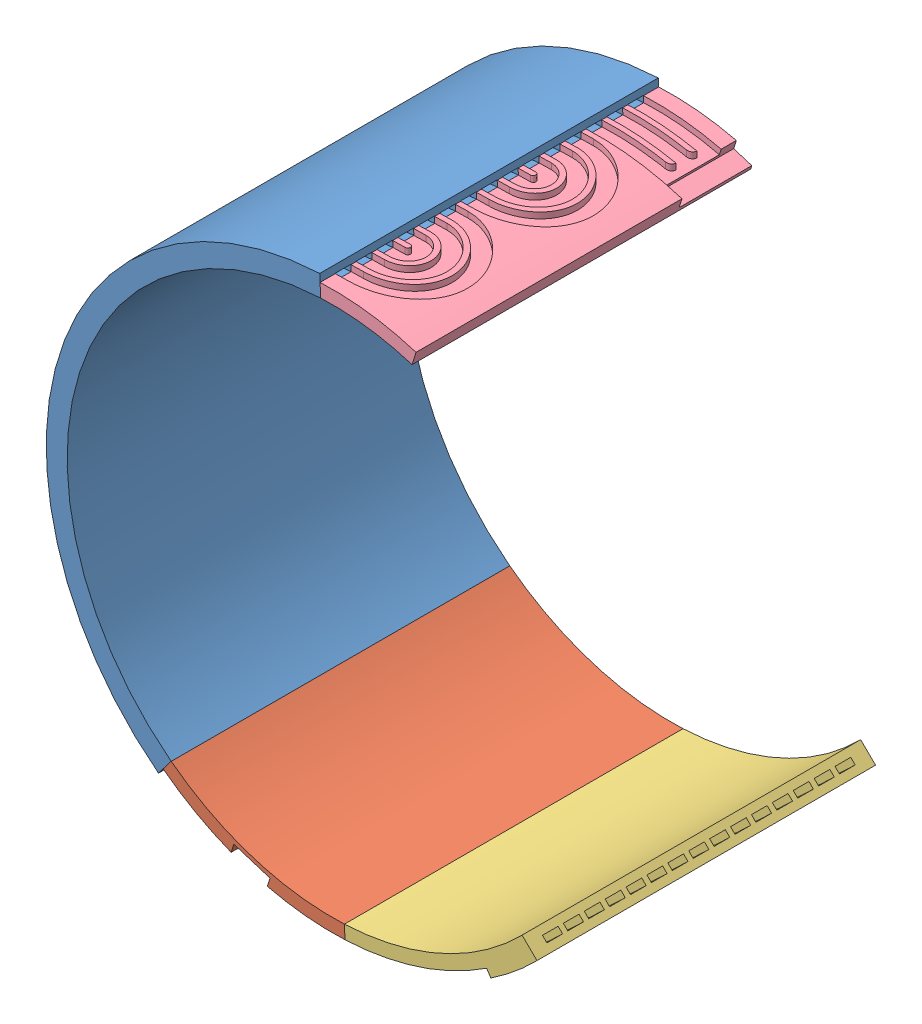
SolidWorks assembly chlazenihotovo.SLDASM, configuration Výchozí (file format 9000). Lengths in mm.
Overall size (189.87 214.49 106.11).
4 component instances, 4 part files, 6 mates.
Components (placement in the parent):
- pokusstatorchlaz.-1: pokusstatorchlaz..SLDPRT [Výchozí] at (-20.3332 -23.1548 -83.9002) x (0 0 -1) z (0.794042 -0.607863 0) size (106.11 158.48 89.73)
- chlazeni3-1: chlazeni3.SLDPRT [Výchozí] at (46.2063 88.9054 -212.3295) x (-1 0 0) z (0 0 1) size (57 21.29 106.11)
- pokus_stator_chlaz_s_vyrezem.-1: pokus_stator_chlaz_s_vyrezem..SLDPRT [Výchozí] at (95.2576 -14.9403 -83.9002) x (0 0 -1) z (0.700101 0.714044 0) size (106.11 28.9 59.57)
- chlazeni4-1: chlazeni4.SLDPRT [Výchozí] at (26.7608 1.3499 -52.0834) x (-0.820449 0.571719 0) z (0 0 -1) size (28.17 17.28 106.11)
Mates (geometry in assembly coordinates):
- Sjednocená1: coincident anti-aligned: line of pokusstatorchlaz.-1 through (-17.7452 -19.7742 -79.1515) axis (0 0 -1); line of chlazeni3-1 through (-17.7452 -19.7742 -185.2615) axis (0 0 1)
- Sjednocená2: coincident aligned: plane of pokusstatorchlaz.-1 through (28.9067 133.6331 -79.1515) normal (0 0 1); plane of chlazeni3-1 through (32.8198 46.2782 -79.1515) normal (0 0 1)
- Sjednocená5: coincident anti-aligned: line of chlazeni3-1 through (36.5424 -36.8234 -185.2615) axis (0 0 1); line of pokus_stator_chlaz_s_vyrezem.-1 through (36.5424 -36.8234 -79.1515) axis (0 0 -1)
- Sjednocená6: coincident aligned: plane of chlazeni3-1 through (32.8198 46.2782 -79.1515) normal (0 0 1); plane of pokus_stator_chlaz_s_vyrezem.-1 through (-54.3608 53.0402 -79.1515) normal (0 0 1)
- Sjednocená7: coincident aligned: line of pokusstatorchlaz.-1 through (29.0972 129.3799 -79.1515) axis (0 0 -1); line of chlazeni4-1 through (29.0972 129.3799 -79.1515) axis (0 0 -1)
- Sjednocená9: coincident aligned: plane of pokusstatorchlaz.-1 through (28.9067 133.6331 -79.1515) normal (0 0 1); plane of chlazeni4-1 through (32.8198 46.2782 -79.1515) normal (0 0 1)
